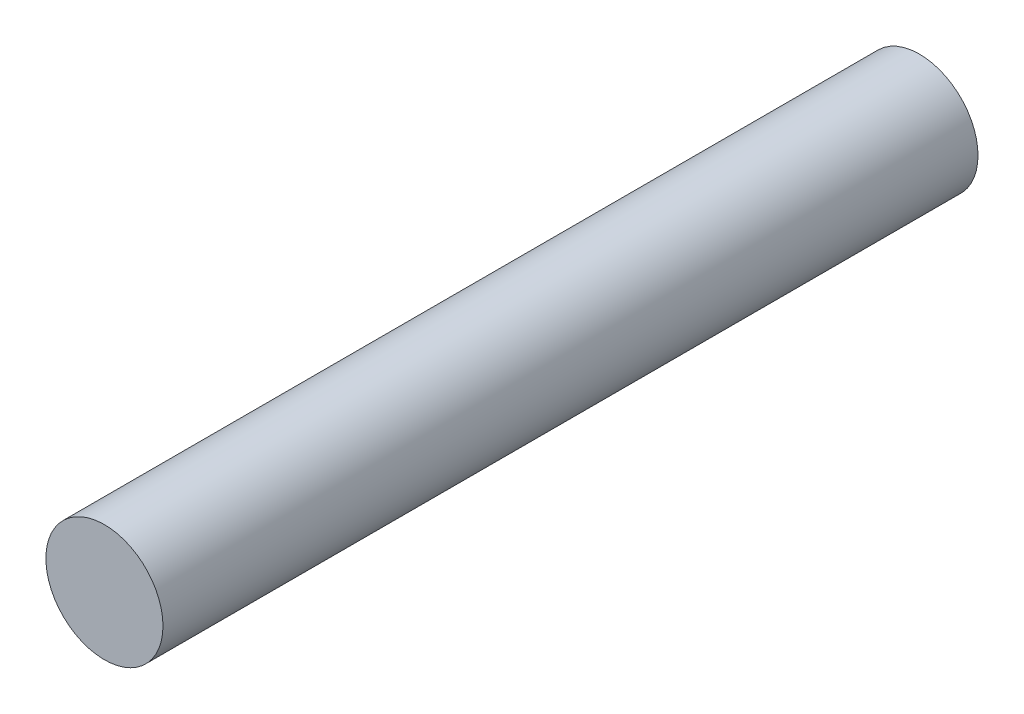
ISO-10303-21;
HEADER;
FILE_DESCRIPTION(('STEP AP214'),'2;1');
FILE_NAME('part.step','',(''),(''),'','','');
FILE_SCHEMA(('AUTOMOTIVE_DESIGN { 1 0 10303 214 1 1 1 1 }'));
ENDSEC;
DATA;
#1=APPLICATION_CONTEXT('core data for automotive mechanical design processes');
#2=APPLICATION_PROTOCOL_DEFINITION('international standard','automotive_design',2000,#1);
#3=PRODUCT_CONTEXT('',#1,'mechanical');
#4=PRODUCT('Part','Part','',(#3));
#5=PRODUCT_RELATED_PRODUCT_CATEGORY('part','',(#4));
#6=PRODUCT_DEFINITION_FORMATION('','',#4);
#7=PRODUCT_DEFINITION_CONTEXT('part definition',#1,'design');
#8=PRODUCT_DEFINITION('design','',#6,#7);
#9=PRODUCT_DEFINITION_SHAPE('','',#8);
#10=(LENGTH_UNIT() NAMED_UNIT(*) SI_UNIT(.MILLI.,.METRE.));
#11=(NAMED_UNIT(*) PLANE_ANGLE_UNIT() SI_UNIT($,.RADIAN.));
#12=(NAMED_UNIT(*) SI_UNIT($,.STERADIAN.) SOLID_ANGLE_UNIT());
#13=UNCERTAINTY_MEASURE_WITH_UNIT(LENGTH_MEASURE(1.E-05),#10,'distance_accuracy_value','');
#14=(GEOMETRIC_REPRESENTATION_CONTEXT(3) GLOBAL_UNCERTAINTY_ASSIGNED_CONTEXT((#13)) GLOBAL_UNIT_ASSIGNED_CONTEXT((#10,
#11,#12)) REPRESENTATION_CONTEXT('',''));
#15=CARTESIAN_POINT('',(0.,0.,0.));
#16=DIRECTION('',(0.,0.,1.));
#17=DIRECTION('',(1.,0.,0.));
#18=AXIS2_PLACEMENT_3D('',#15,#16,#17);
#19=CARTESIAN_POINT('',(0.,0.,355.));
#20=DIRECTION('',(0.,0.,-1.));
#21=DIRECTION('',(-1.,0.,0.));
#22=AXIS2_PLACEMENT_3D('',#19,#20,#21);
#23=CYLINDRICAL_SURFACE('',#22,51.);
#24=CARTESIAN_POINT('',(0.,0.,355.));
#25=DIRECTION('',(0.,0.,1.));
#26=DIRECTION('',(1.,0.,0.));
#27=AXIS2_PLACEMENT_3D('',#24,#25,#26);
#28=CIRCLE('',#27,51.);
#29=CARTESIAN_POINT('',(51.,0.,355.));
#30=VERTEX_POINT('',#29);
#31=EDGE_CURVE('E10',#30,#30,#28,.T.);
#32=ORIENTED_EDGE('',*,*,#31,.F.);
#33=EDGE_LOOP('',(#32));
#34=FACE_BOUND('',#33,.T.);
#35=CARTESIAN_POINT('',(0.,0.,-355.));
#36=DIRECTION('',(0.,0.,1.));
#37=DIRECTION('',(1.,0.,0.));
#38=AXIS2_PLACEMENT_3D('',#35,#36,#37);
#39=CIRCLE('',#38,51.);
#40=CARTESIAN_POINT('',(51.,0.,-355.));
#41=VERTEX_POINT('',#40);
#42=EDGE_CURVE('E34',#41,#41,#39,.T.);
#43=ORIENTED_EDGE('',*,*,#42,.T.);
#44=EDGE_LOOP('',(#43));
#45=FACE_BOUND('',#44,.T.);
#46=ADVANCED_FACE('F31',(#34,#45),#23,.T.);
#47=CARTESIAN_POINT('',(0.,0.,355.));
#48=DIRECTION('',(0.,0.,1.));
#49=DIRECTION('',(1.,0.,0.));
#50=AXIS2_PLACEMENT_3D('',#47,#48,#49);
#51=PLANE('',#50);
#52=ORIENTED_EDGE('',*,*,#31,.T.);
#53=EDGE_LOOP('',(#52));
#54=FACE_BOUND('',#53,.T.);
#55=ADVANCED_FACE('F46',(#54),#51,.T.);
#56=CARTESIAN_POINT('',(0.,0.,-355.));
#57=DIRECTION('',(0.,0.,1.));
#58=DIRECTION('',(1.,0.,0.));
#59=AXIS2_PLACEMENT_3D('',#56,#57,#58);
#60=PLANE('',#59);
#61=ORIENTED_EDGE('',*,*,#42,.F.);
#62=EDGE_LOOP('',(#61));
#63=FACE_BOUND('',#62,.T.);
#64=ADVANCED_FACE('F44',(#63),#60,.F.);
#65=CLOSED_SHELL('',(#46,#55,#64));
#66=MANIFOLD_SOLID_BREP('B2',#65);
#67=ADVANCED_BREP_SHAPE_REPRESENTATION('',(#18,#66),#14);
#68=SHAPE_DEFINITION_REPRESENTATION(#9,#67);
ENDSEC;
END-ISO-10303-21;
